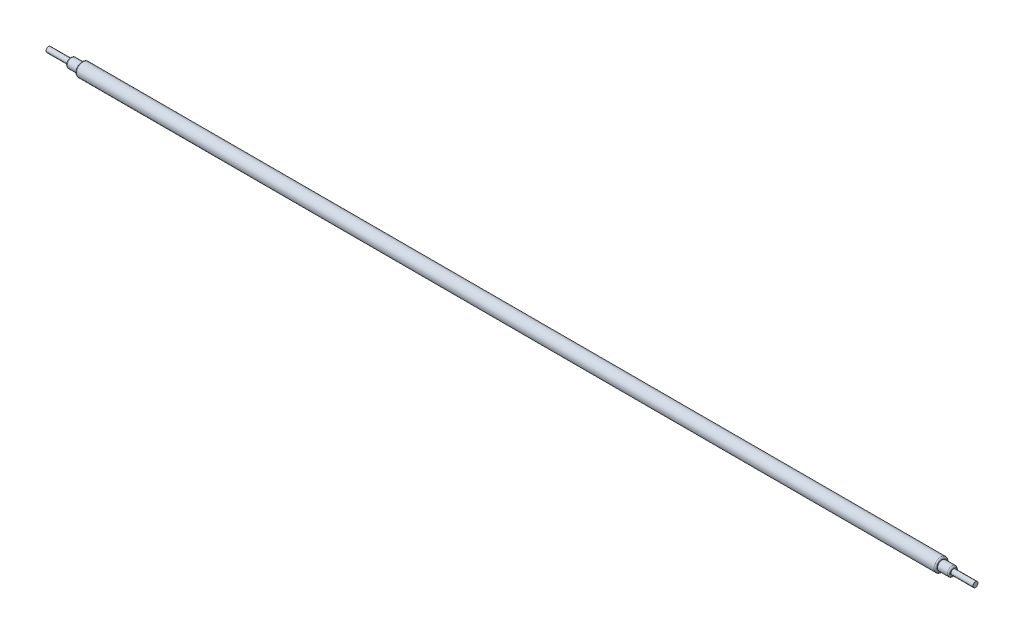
from build123d import *


with BuildPart() as part:
    # Esquisse1 → R_volution1 (revolve)
    with BuildSketch(Plane.XY, mode=Mode.PRIVATE) as r_volution1_sk:
        with BuildLine():
            Line((-347, 0), (-347, 1.9))
            Line((-347, 1.9), (-330.5, 1.9))
            Line((-330.5, 1.9), (-330.5, 2.5))
            ThreePointArc((-330.5, 2.5), (-330.207106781, 3.207106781), (-329.5, 3.5))
            Line((-329.5, 3.5), (-322, 3.5))
            Line((-322, 3.5), (-322, 4))
            ThreePointArc((-322, 4), (-321.707106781, 4.707106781), (-321, 5))
            Line((-321, 5), (321, 5))
            ThreePointArc((321, 5), (321.707106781, 4.707106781), (322, 4))
            Line((322, 4), (322, 3.5))
            Line((322, 3.5), (329.5, 3.5))
            ThreePointArc((329.5, 3.5), (330.207106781, 3.207106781), (330.5, 2.5))
            Line((330.5, 2.5), (330.5, 1.9))
            Line((330.5, 1.9), (347, 1.9))
            Line((347, 1.9), (347, 0))
            Line((347, 0), (-347, 0))
        make_face()
    revolve(r_volution1_sk.sketch.rotate(Axis((-347, 0, 0), (1, 0, 0)), 90), axis=Axis((-347, 0, 0), (1, 0, 0)))


solid = part.part
